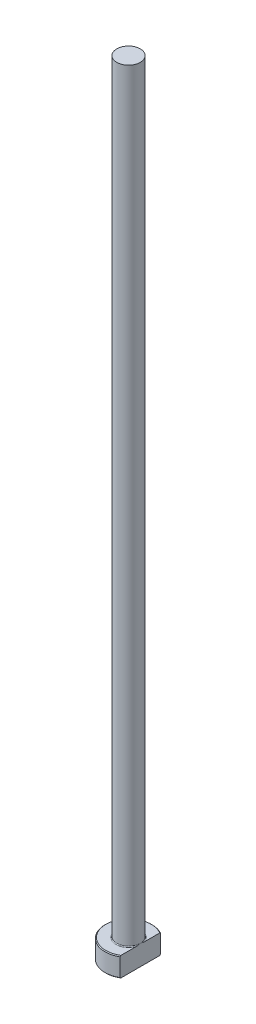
ISO-10303-21;
HEADER;
FILE_DESCRIPTION(('STEP AP214'),'2;1');
FILE_NAME('part.step','',(''),(''),'','','');
FILE_SCHEMA(('AUTOMOTIVE_DESIGN { 1 0 10303 214 1 1 1 1 }'));
ENDSEC;
DATA;
#1=APPLICATION_CONTEXT('core data for automotive mechanical design processes');
#2=APPLICATION_PROTOCOL_DEFINITION('international standard','automotive_design',2000,#1);
#3=PRODUCT_CONTEXT('',#1,'mechanical');
#4=PRODUCT('Part','Part','',(#3));
#5=PRODUCT_RELATED_PRODUCT_CATEGORY('part','',(#4));
#6=PRODUCT_DEFINITION_FORMATION('','',#4);
#7=PRODUCT_DEFINITION_CONTEXT('part definition',#1,'design');
#8=PRODUCT_DEFINITION('design','',#6,#7);
#9=PRODUCT_DEFINITION_SHAPE('','',#8);
#10=(LENGTH_UNIT() NAMED_UNIT(*) SI_UNIT(.MILLI.,.METRE.));
#11=(NAMED_UNIT(*) PLANE_ANGLE_UNIT() SI_UNIT($,.RADIAN.));
#12=(NAMED_UNIT(*) SI_UNIT($,.STERADIAN.) SOLID_ANGLE_UNIT());
#13=UNCERTAINTY_MEASURE_WITH_UNIT(LENGTH_MEASURE(1.E-05),#10,'distance_accuracy_value','');
#14=(GEOMETRIC_REPRESENTATION_CONTEXT(3) GLOBAL_UNCERTAINTY_ASSIGNED_CONTEXT((#13)) GLOBAL_UNIT_ASSIGNED_CONTEXT((#10,
#11,#12)) REPRESENTATION_CONTEXT('',''));
#15=CARTESIAN_POINT('',(0.,0.,0.));
#16=DIRECTION('',(0.,0.,1.));
#17=DIRECTION('',(1.,0.,0.));
#18=AXIS2_PLACEMENT_3D('',#15,#16,#17);
#19=CARTESIAN_POINT('',(0.,0.,0.));
#20=DIRECTION('',(0.,-1.,0.));
#21=DIRECTION('',(0.,0.,-1.));
#22=AXIS2_PLACEMENT_3D('',#19,#20,#21);
#23=PLANE('',#22);
#24=CARTESIAN_POINT('',(0.,0.,0.));
#25=DIRECTION('',(0.,-1.,0.));
#26=DIRECTION('',(0.,0.,-1.));
#27=AXIS2_PLACEMENT_3D('',#24,#25,#26);
#28=CIRCLE('',#27,5.79999999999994);
#29=CARTESIAN_POINT('',(2.99999999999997,0.,4.9638694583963));
#30=VERTEX_POINT('',#29);
#31=CARTESIAN_POINT('',(2.99999999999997,0.,-4.9638694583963));
#32=VERTEX_POINT('',#31);
#33=EDGE_CURVE('E98',#30,#32,#28,.T.);
#34=ORIENTED_EDGE('',*,*,#33,.T.);
#35=DIRECTION('',(0.,0.,1.));
#36=VECTOR('',#35,1.);
#37=CARTESIAN_POINT('',(2.99999999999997,0.,-5.19615242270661));
#38=LINE('',#37,#36);
#39=EDGE_CURVE('E83',#32,#30,#38,.T.);
#40=ORIENTED_EDGE('',*,*,#39,.T.);
#41=EDGE_LOOP('',(#34,#40));
#42=FACE_BOUND('',#41,.T.);
#43=ADVANCED_FACE('F32',(#42),#23,.T.);
#44=CARTESIAN_POINT('',(0.,259.958771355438,0.));
#45=DIRECTION('',(0.,1.,0.));
#46=DIRECTION('',(0.,0.,1.));
#47=AXIS2_PLACEMENT_3D('',#44,#45,#46);
#48=CYLINDRICAL_SURFACE('',#47,5.99999999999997);
#49=CARTESIAN_POINT('',(0.,4.80000000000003,0.));
#50=DIRECTION('',(0.,1.,0.));
#51=DIRECTION('',(0.,0.,1.));
#52=AXIS2_PLACEMENT_3D('',#49,#50,#51);
#53=CIRCLE('',#52,5.99999999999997);
#54=CARTESIAN_POINT('',(2.99999999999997,4.80000000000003,5.19615242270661));
#55=VERTEX_POINT('',#54);
#56=CARTESIAN_POINT('',(2.99999999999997,4.80000000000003,-5.19615242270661));
#57=VERTEX_POINT('',#56);
#58=EDGE_CURVE('E104',#55,#57,#53,.F.);
#59=ORIENTED_EDGE('',*,*,#58,.T.);
#60=DIRECTION('',(0.,-1.,0.));
#61=VECTOR('',#60,1.);
#62=CARTESIAN_POINT('',(2.99999999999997,200.,-5.19615242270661));
#63=LINE('',#62,#61);
#64=CARTESIAN_POINT('',(2.99999999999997,0.200000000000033,-5.19615242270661));
#65=VERTEX_POINT('',#64);
#66=EDGE_CURVE('E183',#57,#65,#63,.T.);
#67=ORIENTED_EDGE('',*,*,#66,.T.);
#68=CARTESIAN_POINT('',(0.,0.200000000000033,0.));
#69=DIRECTION('',(0.,-1.,0.));
#70=DIRECTION('',(0.,0.,-1.));
#71=AXIS2_PLACEMENT_3D('',#68,#69,#70);
#72=CIRCLE('',#71,5.99999999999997);
#73=CARTESIAN_POINT('',(2.99999999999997,0.200000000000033,5.19615242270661));
#74=VERTEX_POINT('',#73);
#75=EDGE_CURVE('E100',#65,#74,#72,.F.);
#76=ORIENTED_EDGE('',*,*,#75,.T.);
#77=DIRECTION('',(0.,-1.,0.));
#78=VECTOR('',#77,1.);
#79=CARTESIAN_POINT('',(2.99999999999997,200.,5.19615242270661));
#80=LINE('',#79,#78);
#81=EDGE_CURVE('E93',#55,#74,#80,.T.);
#82=ORIENTED_EDGE('',*,*,#81,.F.);
#83=EDGE_LOOP('',(#59,#67,#76,#82));
#84=FACE_BOUND('',#83,.T.);
#85=ADVANCED_FACE('F158',(#84),#48,.T.);
#86=CARTESIAN_POINT('',(-5.99999999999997,5.,0.));
#87=DIRECTION('',(0.,1.,0.));
#88=DIRECTION('',(0.,0.,1.));
#89=AXIS2_PLACEMENT_3D('',#86,#87,#88);
#90=PLANE('',#89);
#91=CARTESIAN_POINT('',(0.,5.,0.));
#92=DIRECTION('',(0.,1.,0.));
#93=DIRECTION('',(0.,0.,1.));
#94=AXIS2_PLACEMENT_3D('',#91,#92,#93);
#95=CIRCLE('',#94,5.79999999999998);
#96=CARTESIAN_POINT('',(2.99999999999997,5.,-4.96386945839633));
#97=VERTEX_POINT('',#96);
#98=CARTESIAN_POINT('',(2.99999999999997,5.,4.96386945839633));
#99=VERTEX_POINT('',#98);
#100=EDGE_CURVE('E178',#97,#99,#95,.T.);
#101=ORIENTED_EDGE('',*,*,#100,.T.);
#102=DIRECTION('',(0.,0.,-1.));
#103=VECTOR('',#102,1.);
#104=CARTESIAN_POINT('',(2.99999999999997,5.,0.));
#105=LINE('',#104,#103);
#106=CARTESIAN_POINT('',(2.99999999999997,4.99999999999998,1.11355287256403));
#107=VERTEX_POINT('',#106);
#108=EDGE_CURVE('E57',#99,#107,#105,.T.);
#109=ORIENTED_EDGE('',*,*,#108,.T.);
#110=CARTESIAN_POINT('',(0.,5.,0.));
#111=DIRECTION('',(0.,1.,0.));
#112=DIRECTION('',(0.,0.,1.));
#113=AXIS2_PLACEMENT_3D('',#110,#111,#112);
#114=CIRCLE('',#113,3.19999999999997);
#115=CARTESIAN_POINT('',(2.99999999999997,4.99999999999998,-1.113552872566));
#116=VERTEX_POINT('',#115);
#117=EDGE_CURVE('E107',#107,#116,#114,.F.);
#118=ORIENTED_EDGE('',*,*,#117,.T.);
#119=EDGE_CURVE('E136',#116,#97,#105,.T.);
#120=ORIENTED_EDGE('',*,*,#119,.T.);
#121=EDGE_LOOP('',(#101,#109,#118,#120));
#122=FACE_BOUND('',#121,.T.);
#123=ADVANCED_FACE('F147',(#122),#90,.T.);
#124=CARTESIAN_POINT('',(0.,5.,0.));
#125=DIRECTION('',(0.,-1.,0.));
#126=DIRECTION('',(0.,0.,-1.));
#127=AXIS2_PLACEMENT_3D('',#124,#125,#126);
#128=CONICAL_SURFACE('',#127,5.79999999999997,0.785398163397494);
#129=ORIENTED_EDGE('',*,*,#58,.F.);
#130=CARTESIAN_POINT('',(2.99999999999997,-1.01993959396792,11.432889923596));
#131=CARTESIAN_POINT('',(2.99999999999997,-0.769424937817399,11.1738796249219));
#132=CARTESIAN_POINT('',(2.99999999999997,-0.519179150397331,10.9146084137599));
#133=CARTESIAN_POINT('',(2.99999999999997,-0.0193842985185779,10.395389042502));
#134=CARTESIAN_POINT('',(2.99999999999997,0.230164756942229,10.1354408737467));
#135=CARTESIAN_POINT('',(2.99999999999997,0.728528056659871,9.61458602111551));
#136=CARTESIAN_POINT('',(2.99999999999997,0.977341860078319,9.35367891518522));
#137=CARTESIAN_POINT('',(2.99999999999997,1.47386965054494,8.83082274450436));
#138=CARTESIAN_POINT('',(2.99999999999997,1.72158364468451,8.56887368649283));
#139=CARTESIAN_POINT('',(2.99999999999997,2.21069282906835,8.04884148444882));
#140=CARTESIAN_POINT('',(2.99999999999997,2.4521159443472,7.79078462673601));
#141=CARTESIAN_POINT('',(2.99999999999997,2.93315589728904,7.27299342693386));
#142=CARTESIAN_POINT('',(2.99999999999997,3.17277274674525,7.01325909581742));
#143=CARTESIAN_POINT('',(2.99999999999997,3.64950020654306,6.49159990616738));
#144=CARTESIAN_POINT('',(2.99999999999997,3.88661134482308,6.22967553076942));
#145=CARTESIAN_POINT('',(2.99999999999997,4.35738571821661,5.70275148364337));
#146=CARTESIAN_POINT('',(2.99999999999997,4.59104909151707,5.43775193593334));
#147=CARTESIAN_POINT('',(2.99999999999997,4.96416348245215,5.00636825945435));
#148=CARTESIAN_POINT('',(2.99999999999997,5.1052013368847,4.8413584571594));
#149=CARTESIAN_POINT('',(2.99999999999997,5.38476673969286,4.50919282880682));
#150=CARTESIAN_POINT('',(2.99999999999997,5.52329404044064,4.34203679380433));
#151=CARTESIAN_POINT('',(2.99999999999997,5.79842961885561,4.0031993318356));
#152=CARTESIAN_POINT('',(2.99999999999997,5.93500216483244,3.83148875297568));
#153=CARTESIAN_POINT('',(2.99999999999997,6.20336281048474,3.4844211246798));
#154=CARTESIAN_POINT('',(2.99999999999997,6.33515205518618,3.30906496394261));
#155=CARTESIAN_POINT('',(2.99999999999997,6.5939338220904,2.9507080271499));
#156=CARTESIAN_POINT('',(2.99999999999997,6.72082315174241,2.76763161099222));
#157=CARTESIAN_POINT('',(2.99999999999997,6.90336321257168,2.48771743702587));
#158=CARTESIAN_POINT('',(2.99999999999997,6.96295431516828,2.39345390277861));
#159=CARTESIAN_POINT('',(2.99999999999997,7.07882720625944,2.20292146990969));
#160=CARTESIAN_POINT('',(2.99999999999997,7.13510937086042,2.10665280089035));
#161=CARTESIAN_POINT('',(2.99999999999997,7.24288059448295,1.91297779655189));
#162=CARTESIAN_POINT('',(2.99999999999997,7.29441986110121,1.81559978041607));
#163=CARTESIAN_POINT('',(2.99999999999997,7.39241237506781,1.61833215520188));
#164=CARTESIAN_POINT('',(2.99999999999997,7.43886469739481,1.51844209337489));
#165=CARTESIAN_POINT('',(2.99999999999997,7.56840030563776,1.21511948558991));
#166=CARTESIAN_POINT('',(2.99999999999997,7.64209011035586,1.00730397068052));
#167=CARTESIAN_POINT('',(2.99999999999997,7.72186700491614,0.695731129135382));
#168=CARTESIAN_POINT('',(2.99999999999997,7.74302901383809,0.595791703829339));
#169=CARTESIAN_POINT('',(2.99999999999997,7.77582528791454,0.394325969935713));
#170=CARTESIAN_POINT('',(2.99999999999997,7.78746040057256,0.292799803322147));
#171=CARTESIAN_POINT('',(2.99999999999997,7.80037895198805,0.0893987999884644));
#172=CARTESIAN_POINT('',(2.99999999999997,7.80169449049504,-0.0124739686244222));
#173=CARTESIAN_POINT('',(2.99999999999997,7.79396363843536,-0.215826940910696));
#174=CARTESIAN_POINT('',(2.99999999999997,7.78491639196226,-0.317307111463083));
#175=CARTESIAN_POINT('',(2.99999999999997,7.75721241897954,-0.518039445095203));
#176=CARTESIAN_POINT('',(2.99999999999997,7.73863812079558,-0.61730321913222));
#177=CARTESIAN_POINT('',(2.99999999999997,7.6930395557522,-0.813850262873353));
#178=CARTESIAN_POINT('',(2.99999999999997,7.66601427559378,-0.911133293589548));
#179=CARTESIAN_POINT('',(2.99999999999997,7.60464499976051,-1.10394843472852));
#180=CARTESIAN_POINT('',(2.99999999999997,7.57025976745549,-1.19946724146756));
#181=CARTESIAN_POINT('',(2.99999999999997,7.4955576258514,-1.38810736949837));
#182=CARTESIAN_POINT('',(2.99999999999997,7.45524192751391,-1.48122917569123));
#183=CARTESIAN_POINT('',(2.99999999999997,7.36961028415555,-1.66561491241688));
#184=CARTESIAN_POINT('',(2.99999999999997,7.32427350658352,-1.75686908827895));
#185=CARTESIAN_POINT('',(2.99999999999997,7.22966073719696,-1.93732130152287));
#186=CARTESIAN_POINT('',(2.99999999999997,7.18038388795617,-2.02651888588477));
#187=CARTESIAN_POINT('',(2.99999999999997,7.02771106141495,-2.29153460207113));
#188=CARTESIAN_POINT('',(2.99999999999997,6.91955486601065,-2.46460625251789));
#189=CARTESIAN_POINT('',(2.99999999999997,6.69440299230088,-2.80577028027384));
#190=CARTESIAN_POINT('',(2.99999999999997,6.57737415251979,-2.97384034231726));
#191=CARTESIAN_POINT('',(2.99999999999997,6.33748949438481,-3.30561771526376));
#192=CARTESIAN_POINT('',(2.99999999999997,6.21463662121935,-3.46932716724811));
#193=CARTESIAN_POINT('',(2.99999999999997,5.96308085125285,-3.79561670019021));
#194=CARTESIAN_POINT('',(2.99999999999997,5.83432224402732,-3.95815356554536));
#195=CARTESIAN_POINT('',(2.99999999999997,5.57361365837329,-4.28066737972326));
#196=CARTESIAN_POINT('',(2.99999999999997,5.44166333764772,-4.44064405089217));
#197=CARTESIAN_POINT('',(2.99999999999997,5.17568445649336,-4.75819552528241));
#198=CARTESIAN_POINT('',(2.99999999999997,5.04166171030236,-4.91577521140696));
#199=CARTESIAN_POINT('',(2.99999999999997,4.77176230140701,-5.22934053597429));
#200=CARTESIAN_POINT('',(2.99999999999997,4.63588560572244,-5.38532614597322));
#201=CARTESIAN_POINT('',(2.99999999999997,4.27256222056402,-5.79849838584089));
#202=CARTESIAN_POINT('',(2.99999999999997,4.04384014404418,-6.054562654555));
#203=CARTESIAN_POINT('',(2.99999999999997,3.58360020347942,-6.5641703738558));
#204=CARTESIAN_POINT('',(2.99999999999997,3.35208226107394,-6.81771375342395));
#205=CARTESIAN_POINT('',(2.99999999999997,2.88678846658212,-7.32315936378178));
#206=CARTESIAN_POINT('',(2.99999999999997,2.65301069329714,-7.57505982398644));
#207=CARTESIAN_POINT('',(2.99999999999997,2.18392232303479,-8.07742926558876));
#208=CARTESIAN_POINT('',(2.99999999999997,1.94861172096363,-8.32789824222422));
#209=CARTESIAN_POINT('',(2.99999999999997,1.4865158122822,-8.81743943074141));
#210=CARTESIAN_POINT('',(2.99999999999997,1.25977806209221,-9.05655656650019));
#211=CARTESIAN_POINT('',(2.99999999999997,0.805439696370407,-9.53397105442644));
#212=CARTESIAN_POINT('',(2.99999999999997,0.577839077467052,-9.77226840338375));
#213=CARTESIAN_POINT('',(2.99999999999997,0.122198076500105,-10.2479325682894));
#214=CARTESIAN_POINT('',(2.99999999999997,-0.105841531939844,-10.4853001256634));
#215=CARTESIAN_POINT('',(2.99999999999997,-0.562491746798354,-10.9594816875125));
#216=CARTESIAN_POINT('',(2.99999999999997,-0.791102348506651,-11.1962956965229));
#217=CARTESIAN_POINT('',(2.99999999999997,-1.01993959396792,-11.432889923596));
#218=B_SPLINE_CURVE_WITH_KNOTS('',3,(#130,#131,#132,#133,#134,#135,#136,#137,#138,#139,#140,
#141,#142,#143,#144,#145,#146,#147,#148,#149,#150,#151,#152,#153,#154,#155,#156,#157,#158,#159,
#160,#161,#162,#163,#164,#165,#166,#167,#168,#169,#170,#171,#172,#173,#174,#175,#176,#177,#178,
#179,#180,#181,#182,#183,#184,#185,#186,#187,#188,#189,#190,#191,#192,#193,#194,#195,#196,#197,
#198,#199,#200,#201,#202,#203,#204,#205,#206,#207,#208,#209,#210,#211,#212,#213,#214,#215,#216,
#217),.UNSPECIFIED.,.F.,.F.,(4,2,2,2,2,2,2,2,2,2,2,2,2,2,2,2,2,2,2,2,2,2,2,2,2,2,2,2,2,2,2,2,2,
2,2,2,2,2,2,2,2,2,2,4),(0.,1.08101662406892,2.16204714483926,3.24363027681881,4.32520642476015,
5.3853446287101,6.44547590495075,7.50537917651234,8.56523985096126,9.21643479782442,
9.86769362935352,10.5258323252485,11.1838124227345,11.851781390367,12.1862877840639,
12.5207560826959,12.8511332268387,13.1815703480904,13.8399161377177,14.1460077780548,
14.4520721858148,14.7571841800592,15.0623213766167,15.3648619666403,15.6674388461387,
15.9717575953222,16.2760142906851,16.5815843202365,16.8872210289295,17.4990577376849,
18.1133060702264,18.7272470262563,19.3492675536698,19.9713550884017,20.5919343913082,
21.2125247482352,22.2425132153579,23.2725306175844,24.3035181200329,25.3345090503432,
26.3230827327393,27.3116602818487,28.299135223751,29.286602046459),.UNSPECIFIED.);
#219=EDGE_CURVE('E135',#55,#99,#218,.T.);
#220=ORIENTED_EDGE('',*,*,#219,.T.);
#221=ORIENTED_EDGE('',*,*,#100,.F.);
#222=EDGE_CURVE('E127',#97,#57,#218,.T.);
#223=ORIENTED_EDGE('',*,*,#222,.T.);
#224=EDGE_LOOP('',(#129,#220,#221,#223));
#225=FACE_BOUND('',#224,.T.);
#226=ADVANCED_FACE('F143',(#225),#128,.T.);
#227=CARTESIAN_POINT('',(0.,0.200000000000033,0.));
#228=DIRECTION('',(0.,1.,0.));
#229=DIRECTION('',(0.,0.,1.));
#230=AXIS2_PLACEMENT_3D('',#227,#228,#229);
#231=CONICAL_SURFACE('',#230,5.99999999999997,0.785398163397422);
#232=ORIENTED_EDGE('',*,*,#75,.F.);
#233=CARTESIAN_POINT('',(2.99999999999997,6.01993959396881,-11.432889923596));
#234=CARTESIAN_POINT('',(2.99999999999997,5.76942493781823,-11.1738796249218));
#235=CARTESIAN_POINT('',(2.99999999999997,5.5191791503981,-10.9146084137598));
#236=CARTESIAN_POINT('',(2.99999999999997,5.01938429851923,-10.3953890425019));
#237=CARTESIAN_POINT('',(2.99999999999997,4.76983524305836,-10.1354408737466));
#238=CARTESIAN_POINT('',(2.99999999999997,4.27147194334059,-9.61458602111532));
#239=CARTESIAN_POINT('',(2.99999999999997,4.02265813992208,-9.35367891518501));
#240=CARTESIAN_POINT('',(2.99999999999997,3.52613034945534,-8.83082274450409));
#241=CARTESIAN_POINT('',(2.99999999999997,3.27841635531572,-8.56887368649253));
#242=CARTESIAN_POINT('',(2.99999999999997,2.78930717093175,-8.04884148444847));
#243=CARTESIAN_POINT('',(2.99999999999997,2.54788405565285,-7.79078462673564));
#244=CARTESIAN_POINT('',(2.99999999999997,2.0668441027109,-7.27299342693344));
#245=CARTESIAN_POINT('',(2.99999999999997,1.82722725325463,-7.01325909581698));
#246=CARTESIAN_POINT('',(2.99999999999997,1.35049979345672,-6.49159990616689));
#247=CARTESIAN_POINT('',(2.99999999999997,1.11338865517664,-6.2296755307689));
#248=CARTESIAN_POINT('',(2.99999999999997,0.642614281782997,-5.70275148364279));
#249=CARTESIAN_POINT('',(2.99999999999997,0.408950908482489,-5.43775193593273));
#250=CARTESIAN_POINT('',(2.99999999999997,0.0358365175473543,-5.00636825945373));
#251=CARTESIAN_POINT('',(2.99999999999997,-0.105201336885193,-4.8413584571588));
#252=CARTESIAN_POINT('',(2.99999999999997,-0.384766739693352,-4.50919282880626));
#253=CARTESIAN_POINT('',(2.99999999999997,-0.523294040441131,-4.34203679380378));
#254=CARTESIAN_POINT('',(2.99999999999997,-0.7984296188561,-4.00319933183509));
#255=CARTESIAN_POINT('',(2.99999999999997,-0.935002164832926,-3.83148875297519));
#256=CARTESIAN_POINT('',(2.99999999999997,-1.20336281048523,-3.48442112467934));
#257=CARTESIAN_POINT('',(2.99999999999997,-1.33515205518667,-3.30906496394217));
#258=CARTESIAN_POINT('',(2.99999999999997,-1.59393382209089,-2.95070802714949));
#259=CARTESIAN_POINT('',(2.99999999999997,-1.7208231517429,-2.76763161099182));
#260=CARTESIAN_POINT('',(2.99999999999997,-1.90336321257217,-2.48771743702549));
#261=CARTESIAN_POINT('',(2.99999999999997,-1.96295431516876,-2.39345390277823));
#262=CARTESIAN_POINT('',(2.99999999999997,-2.07882720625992,-2.20292146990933));
#263=CARTESIAN_POINT('',(2.99999999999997,-2.1351093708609,-2.10665280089));
#264=CARTESIAN_POINT('',(2.99999999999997,-2.24288059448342,-1.91297779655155));
#265=CARTESIAN_POINT('',(2.99999999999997,-2.29441986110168,-1.81559978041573));
#266=CARTESIAN_POINT('',(2.99999999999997,-2.39241237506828,-1.61833215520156));
#267=CARTESIAN_POINT('',(2.99999999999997,-2.43886469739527,-1.51844209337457));
#268=CARTESIAN_POINT('',(2.99999999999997,-2.56840030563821,-1.2151194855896));
#269=CARTESIAN_POINT('',(2.99999999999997,-2.6420901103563,-1.00730397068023));
#270=CARTESIAN_POINT('',(2.99999999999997,-2.72186700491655,-0.69573112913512));
#271=CARTESIAN_POINT('',(2.99999999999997,-2.7430290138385,-0.595791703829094));
#272=CARTESIAN_POINT('',(2.99999999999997,-2.77582528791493,-0.394325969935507));
#273=CARTESIAN_POINT('',(2.99999999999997,-2.78746040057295,-0.292799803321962));
#274=CARTESIAN_POINT('',(2.99999999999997,-2.80037895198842,-0.0893987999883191));
#275=CARTESIAN_POINT('',(2.99999999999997,-2.8016944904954,0.0124739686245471));
#276=CARTESIAN_POINT('',(2.99999999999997,-2.79396363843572,0.215826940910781));
#277=CARTESIAN_POINT('',(2.99999999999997,-2.78491639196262,0.317307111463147));
#278=CARTESIAN_POINT('',(2.99999999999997,-2.7572124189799,0.518039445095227));
#279=CARTESIAN_POINT('',(2.99999999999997,-2.73863812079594,0.617303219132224));
#280=CARTESIAN_POINT('',(2.99999999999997,-2.69303955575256,0.813850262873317));
#281=CARTESIAN_POINT('',(2.99999999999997,-2.66601427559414,0.911133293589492));
#282=CARTESIAN_POINT('',(2.99999999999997,-2.60464499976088,1.10394843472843));
#283=CARTESIAN_POINT('',(2.99999999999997,-2.57025976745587,1.19946724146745));
#284=CARTESIAN_POINT('',(2.99999999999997,-2.49555762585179,1.38810736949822));
#285=CARTESIAN_POINT('',(2.99999999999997,-2.4552419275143,1.48122917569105));
#286=CARTESIAN_POINT('',(2.99999999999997,-2.36961028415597,1.66561491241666));
#287=CARTESIAN_POINT('',(2.99999999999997,-2.32427350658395,1.7568690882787));
#288=CARTESIAN_POINT('',(2.99999999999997,-2.22966073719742,1.93732130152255));
#289=CARTESIAN_POINT('',(2.99999999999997,-2.18038388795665,2.02651888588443));
#290=CARTESIAN_POINT('',(2.99999999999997,-2.02771106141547,2.2915346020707));
#291=CARTESIAN_POINT('',(2.99999999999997,-1.91955486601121,2.4646062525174));
#292=CARTESIAN_POINT('',(2.99999999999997,-1.6944029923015,2.80577028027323));
#293=CARTESIAN_POINT('',(2.99999999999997,-1.57737415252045,2.9738403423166));
#294=CARTESIAN_POINT('',(2.99999999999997,-1.33748949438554,3.30561771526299));
#295=CARTESIAN_POINT('',(2.99999999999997,-1.21463662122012,3.46932716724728));
#296=CARTESIAN_POINT('',(2.99999999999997,-0.96308085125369,3.79561670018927));
#297=CARTESIAN_POINT('',(2.99999999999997,-0.834322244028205,3.95815356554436));
#298=CARTESIAN_POINT('',(2.99999999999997,-0.573613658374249,4.28066737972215));
#299=CARTESIAN_POINT('',(2.99999999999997,-0.441663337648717,4.440644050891));
#300=CARTESIAN_POINT('',(2.99999999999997,-0.175684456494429,4.75819552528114));
#301=CARTESIAN_POINT('',(2.99999999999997,-0.0416617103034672,4.91577521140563));
#302=CARTESIAN_POINT('',(2.99999999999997,0.228237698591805,5.22934053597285));
#303=CARTESIAN_POINT('',(2.99999999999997,0.364114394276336,5.38532614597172));
#304=CARTESIAN_POINT('',(2.99999999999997,0.727437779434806,5.79849838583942));
#305=CARTESIAN_POINT('',(2.99999999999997,0.956159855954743,6.05456265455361));
#306=CARTESIAN_POINT('',(2.99999999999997,1.41639979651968,6.56417037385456));
#307=CARTESIAN_POINT('',(2.99999999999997,1.64791773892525,6.81771375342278));
#308=CARTESIAN_POINT('',(2.99999999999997,2.11321153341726,7.32315936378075));
#309=CARTESIAN_POINT('',(2.99999999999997,2.34698930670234,7.57505982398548));
#310=CARTESIAN_POINT('',(2.99999999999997,2.81607767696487,8.07742926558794));
#311=CARTESIAN_POINT('',(2.99999999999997,3.05138827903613,8.32789824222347));
#312=CARTESIAN_POINT('',(2.99999999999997,3.51348418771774,8.81743943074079));
#313=CARTESIAN_POINT('',(2.99999999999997,3.74022193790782,9.05655656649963));
#314=CARTESIAN_POINT('',(2.99999999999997,4.1945603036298,9.53397105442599));
#315=CARTESIAN_POINT('',(2.99999999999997,4.42216092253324,9.77226840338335));
#316=CARTESIAN_POINT('',(2.99999999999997,4.87780192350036,10.2479325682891));
#317=CARTESIAN_POINT('',(2.99999999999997,5.10584153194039,10.4853001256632));
#318=CARTESIAN_POINT('',(2.99999999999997,5.56249174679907,10.9594816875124));
#319=CARTESIAN_POINT('',(2.99999999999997,5.79110234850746,11.1962956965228));
#320=CARTESIAN_POINT('',(2.99999999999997,6.01993959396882,11.432889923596));
#321=B_SPLINE_CURVE_WITH_KNOTS('',3,(#233,#234,#235,#236,#237,#238,#239,#240,#241,#242,#243,
#244,#245,#246,#247,#248,#249,#250,#251,#252,#253,#254,#255,#256,#257,#258,#259,#260,#261,#262,
#263,#264,#265,#266,#267,#268,#269,#270,#271,#272,#273,#274,#275,#276,#277,#278,#279,#280,#281,
#282,#283,#284,#285,#286,#287,#288,#289,#290,#291,#292,#293,#294,#295,#296,#297,#298,#299,#300,
#301,#302,#303,#304,#305,#306,#307,#308,#309,#310,#311,#312,#313,#314,#315,#316,#317,#318,#319,
#320),.UNSPECIFIED.,.F.,.F.,(4,2,2,2,2,2,2,2,2,2,2,2,2,2,2,2,2,2,2,2,2,2,2,2,2,2,2,2,2,2,2,2,2,
2,2,2,2,2,2,2,2,2,2,4),(0.,1.08101662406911,2.16204714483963,3.24363027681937,4.32520642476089,
5.38534462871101,6.44547590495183,7.50537917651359,8.56523985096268,9.21643479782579,
9.86769362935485,10.5258323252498,11.1838124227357,11.8517813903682,12.1862877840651,
12.5207560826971,12.8511332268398,13.1815703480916,13.8399161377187,14.1460077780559,
14.4520721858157,14.7571841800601,15.0623213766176,15.3648619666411,15.6674388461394,
15.9717575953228,16.2760142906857,16.581584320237,16.8872210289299,17.4990577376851,
18.1133060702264,18.7272470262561,19.3492675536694,19.9713550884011,20.5919343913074,
21.2125247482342,22.2425132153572,23.2725306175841,24.3035181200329,25.3345090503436,
26.32308273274,27.3116602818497,28.2991352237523,29.2866020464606),.UNSPECIFIED.);
#322=EDGE_CURVE('E86',#65,#32,#321,.T.);
#323=ORIENTED_EDGE('',*,*,#322,.T.);
#324=ORIENTED_EDGE('',*,*,#33,.F.);
#325=EDGE_CURVE('E89',#30,#74,#321,.T.);
#326=ORIENTED_EDGE('',*,*,#325,.T.);
#327=EDGE_LOOP('',(#232,#323,#324,#326));
#328=FACE_BOUND('',#327,.T.);
#329=ADVANCED_FACE('F97',(#328),#231,.T.);
#330=CARTESIAN_POINT('',(0.,5.19999999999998,0.));
#331=DIRECTION('',(0.,1.,0.));
#332=DIRECTION('',(0.,0.,1.));
#333=AXIS2_PLACEMENT_3D('',#330,#331,#332);
#334=TOROIDAL_SURFACE('',#333,3.19999999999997,0.2);
#335=CARTESIAN_POINT('',(2.99999999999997,5.19999999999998,0.));
#336=CARTESIAN_POINT('',(2.99999999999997,5.20000054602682,-8.25589702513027E-09));
#337=CARTESIAN_POINT('',(2.99999999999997,5.20000108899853,-2.22623702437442E-07));
#338=CARTESIAN_POINT('',(2.99999999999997,5.20000210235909,-8.13181300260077E-07));
#339=CARTESIAN_POINT('',(2.99999999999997,5.20000256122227,-1.20262206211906E-06));
#340=CARTESIAN_POINT('',(2.99999999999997,5.20000351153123,-2.13233189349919E-06));
#341=CARTESIAN_POINT('',(2.99999999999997,5.2000039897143,-2.68711073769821E-06));
#342=CARTESIAN_POINT('',(2.99999999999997,5.20000484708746,-3.83722986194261E-06));
#343=CARTESIAN_POINT('',(2.99999999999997,5.20000522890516,-4.43075968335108E-06));
#344=CARTESIAN_POINT('',(2.99999999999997,5.20000663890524,-6.71805399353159E-06));
#345=CARTESIAN_POINT('',(2.99999999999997,5.20000758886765,-8.46267320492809E-06));
#346=CARTESIAN_POINT('',(2.99999999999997,5.20000915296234,-1.19195937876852E-05));
#347=CARTESIAN_POINT('',(2.99999999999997,5.20000978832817,-1.36226966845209E-05));
#348=CARTESIAN_POINT('',(2.99999999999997,5.20001243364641,-2.07785327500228E-05));
#349=CARTESIAN_POINT('',(2.99999999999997,5.20001439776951,-2.62512686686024E-05));
#350=CARTESIAN_POINT('',(2.99999999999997,5.20001730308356,-3.65971251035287E-05));
#351=CARTESIAN_POINT('',(2.99999999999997,5.20001835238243,-4.14397201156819E-05));
#352=CARTESIAN_POINT('',(2.99999999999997,5.20002589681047,-7.68826107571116E-05));
#353=CARTESIAN_POINT('',(2.99999999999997,5.20003169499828,-0.000107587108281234));
#354=CARTESIAN_POINT('',(2.99999999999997,5.20005649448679,-0.000225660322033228));
#355=CARTESIAN_POINT('',(2.99999999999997,5.2000799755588,-0.000312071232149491));
#356=CARTESIAN_POINT('',(2.99999999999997,5.2001671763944,-0.000638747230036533));
#357=CARTESIAN_POINT('',(2.99999999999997,5.20022823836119,-0.000879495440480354));
#358=CARTESIAN_POINT('',(2.99999999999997,5.20046253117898,-0.00179757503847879));
#359=CARTESIAN_POINT('',(2.99999999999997,5.20063826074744,-0.00247448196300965));
#360=CARTESIAN_POINT('',(2.99999999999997,5.20145771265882,-0.00563611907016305));
#361=CARTESIAN_POINT('',(2.99999999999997,5.20209802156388,-0.00812138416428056));
#362=CARTESIAN_POINT('',(2.99999999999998,5.207470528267,-0.0289666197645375));
#363=CARTESIAN_POINT('',(2.99999999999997,5.2122144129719,-0.0473249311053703));
#364=CARTESIAN_POINT('',(2.99999999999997,5.2215041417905,-0.0833908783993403));
#365=CARTESIAN_POINT('',(2.99999999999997,5.22605099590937,-0.101098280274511));
#366=CARTESIAN_POINT('',(2.99999999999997,5.24071513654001,-0.158441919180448));
#367=CARTESIAN_POINT('',(2.99999999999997,5.25076238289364,-0.198096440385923));
#368=CARTESIAN_POINT('',(2.99999999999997,5.26735876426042,-0.264903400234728));
#369=CARTESIAN_POINT('',(2.99999999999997,5.27400650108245,-0.292031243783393));
#370=CARTESIAN_POINT('',(2.99999999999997,5.28691139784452,-0.345693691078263));
#371=CARTESIAN_POINT('',(2.99999999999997,5.29317409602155,-0.372226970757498));
#372=CARTESIAN_POINT('',(2.99999999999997,5.31359314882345,-0.460847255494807));
#373=CARTESIAN_POINT('',(2.99999999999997,5.3271194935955,-0.52308420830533));
#374=CARTESIAN_POINT('',(2.99999999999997,5.35185224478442,-0.648627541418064));
#375=CARTESIAN_POINT('',(2.99999999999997,5.36303576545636,-0.711938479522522));
#376=CARTESIAN_POINT('',(2.99999999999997,5.382697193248,-0.845442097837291));
#377=CARTESIAN_POINT('',(2.99999999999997,5.39079783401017,-0.915695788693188));
#378=CARTESIAN_POINT('',(2.99999999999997,5.39788104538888,-1.02128246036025));
#379=CARTESIAN_POINT('',(2.99999999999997,5.399399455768,-1.05644278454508));
#380=CARTESIAN_POINT('',(2.99999999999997,5.40031405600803,-1.12678521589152));
#381=CARTESIAN_POINT('',(2.99999999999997,5.39971158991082,-1.16196729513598));
#382=CARTESIAN_POINT('',(2.99999999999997,5.39660553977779,-1.21713951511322));
#383=CARTESIAN_POINT('',(2.99999999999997,5.39502683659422,-1.23718181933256));
#384=CARTESIAN_POINT('',(2.99999999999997,5.39080008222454,-1.27717351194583));
#385=CARTESIAN_POINT('',(2.99999999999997,5.38815120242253,-1.29712281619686));
#386=CARTESIAN_POINT('',(2.99999999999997,5.38160570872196,-1.33655702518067));
#387=CARTESIAN_POINT('',(2.99999999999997,5.37772556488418,-1.35604460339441));
#388=CARTESIAN_POINT('',(2.99999999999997,5.36841119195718,-1.39463554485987));
#389=CARTESIAN_POINT('',(2.99999999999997,5.36297874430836,-1.41373932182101));
#390=CARTESIAN_POINT('',(2.99999999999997,5.3500393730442,-1.45151809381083));
#391=CARTESIAN_POINT('',(2.99999999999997,5.34250654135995,-1.47018435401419));
#392=CARTESIAN_POINT('',(2.99999999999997,5.32469433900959,-1.50617232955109));
#393=CARTESIAN_POINT('',(2.99999999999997,5.31442814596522,-1.52349999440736));
#394=CARTESIAN_POINT('',(2.99999999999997,5.29768486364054,-1.5453003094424));
#395=CARTESIAN_POINT('',(2.99999999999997,5.29285641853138,-1.551032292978));
#396=CARTESIAN_POINT('',(2.99999999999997,5.28257691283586,-1.56192749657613));
#397=CARTESIAN_POINT('',(2.99999999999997,5.27712536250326,-1.56709026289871));
#398=CARTESIAN_POINT('',(2.99999999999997,5.26548354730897,-1.57666725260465));
#399=CARTESIAN_POINT('',(2.99999999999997,5.25928560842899,-1.58107232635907));
#400=CARTESIAN_POINT('',(2.99999999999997,5.24620912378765,-1.5887219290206));
#401=CARTESIAN_POINT('',(2.99999999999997,5.23933242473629,-1.59196950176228));
#402=CARTESIAN_POINT('',(2.99999999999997,5.22702406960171,-1.5962468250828));
#403=CARTESIAN_POINT('',(2.99999999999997,5.2217197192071,-1.59764171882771));
#404=CARTESIAN_POINT('',(2.99999999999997,5.2109516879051,-1.59951721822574));
#405=CARTESIAN_POINT('',(2.99999999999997,5.20548813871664,-1.59999855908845));
#406=CARTESIAN_POINT('',(2.99999999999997,5.19455397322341,-1.60000143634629));
#407=CARTESIAN_POINT('',(2.99999999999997,5.18908335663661,-1.59952177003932));
#408=CARTESIAN_POINT('',(2.99999999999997,5.17830149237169,-1.59764696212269));
#409=CARTESIAN_POINT('',(2.99999999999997,5.17299036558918,-1.59625114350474));
#410=CARTESIAN_POINT('',(2.99999999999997,5.16137413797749,-1.5922159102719));
#411=CARTESIAN_POINT('',(2.99999999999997,5.15514663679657,-1.58935479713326));
#412=CARTESIAN_POINT('',(2.99999999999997,5.14323789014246,-1.58266473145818));
#413=CARTESIAN_POINT('',(2.99999999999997,5.13755768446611,-1.57883398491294));
#414=CARTESIAN_POINT('',(2.99999999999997,5.12388989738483,-1.5682309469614));
#415=CARTESIAN_POINT('',(2.99999999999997,5.11627920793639,-1.56097697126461));
#416=CARTESIAN_POINT('',(2.99999999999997,5.10222993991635,-1.54541986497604));
#417=CARTESIAN_POINT('',(2.99999999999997,5.09579438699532,-1.53711411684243));
#418=CARTESIAN_POINT('',(2.99999999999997,5.07874447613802,-1.51234359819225));
#419=CARTESIAN_POINT('',(2.99999999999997,5.06934681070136,-1.49505024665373));
#420=CARTESIAN_POINT('',(2.99999999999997,5.05300413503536,-1.45936637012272));
#421=CARTESIAN_POINT('',(2.99999999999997,5.04606563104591,-1.440973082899));
#422=CARTESIAN_POINT('',(2.99999999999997,5.03343712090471,-1.40170303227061));
#423=CARTESIAN_POINT('',(2.99999999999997,5.02794514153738,-1.38076360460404));
#424=CARTESIAN_POINT('',(2.99999999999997,5.01869119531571,-1.33849708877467));
#425=CARTESIAN_POINT('',(2.99999999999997,5.01493126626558,-1.31716957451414));
#426=CARTESIAN_POINT('',(2.99999999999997,5.00879575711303,-1.27427301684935));
#427=CARTESIAN_POINT('',(2.99999999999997,5.00642327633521,-1.25270354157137));
#428=CARTESIAN_POINT('',(2.99999999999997,5.00283272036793,-1.20948719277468));
#429=CARTESIAN_POINT('',(2.99999999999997,5.00161392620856,-1.18784037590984));
#430=CARTESIAN_POINT('',(2.99999999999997,4.99921193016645,-1.11739576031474));
#431=CARTESIAN_POINT('',(2.99999999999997,4.99998309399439,-1.06853061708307));
#432=CARTESIAN_POINT('',(2.99999999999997,5.00498456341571,-0.970964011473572));
#433=CARTESIAN_POINT('',(2.99999999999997,5.00921876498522,-0.922262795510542));
#434=CARTESIAN_POINT('',(2.99999999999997,5.02027934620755,-0.825023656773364));
#435=CARTESIAN_POINT('',(2.99999999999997,5.02711306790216,-0.776486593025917));
#436=CARTESIAN_POINT('',(2.99999999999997,5.04272509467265,-0.679720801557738));
#437=CARTESIAN_POINT('',(2.99999999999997,5.05150395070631,-0.631492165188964));
#438=CARTESIAN_POINT('',(2.99999999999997,5.07999589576,-0.487173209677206));
#439=CARTESIAN_POINT('',(2.99999999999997,5.10185558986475,-0.391514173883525));
#440=CARTESIAN_POINT('',(2.99999999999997,5.14819769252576,-0.200831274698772));
#441=CARTESIAN_POINT('',(2.99999999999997,5.17268119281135,-0.105807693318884));
#442=CARTESIAN_POINT('',(2.99999999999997,5.19722910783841,-0.0107318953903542));
#443=CARTESIAN_POINT('',(2.99999999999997,5.19724528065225,-0.0106692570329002));
#444=CARTESIAN_POINT('',(2.99999999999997,5.19781243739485,-0.00847232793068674));
#445=CARTESIAN_POINT('',(2.99999999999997,5.19836102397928,-0.00633759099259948));
#446=CARTESIAN_POINT('',(2.99999999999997,5.1991597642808,-0.00325873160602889));
#447=CARTESIAN_POINT('',(2.99999999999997,5.19940591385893,-0.00231386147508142));
#448=CARTESIAN_POINT('',(2.99999999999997,5.19972567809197,-0.00105818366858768));
#449=CARTESIAN_POINT('',(2.99999999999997,5.19980400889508,-0.000748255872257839));
#450=CARTESIAN_POINT('',(2.99999999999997,5.1999122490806,-0.000340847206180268));
#451=CARTESIAN_POINT('',(2.99999999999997,5.19993871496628,-0.000242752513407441));
#452=CARTESIAN_POINT('',(2.99999999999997,5.19996623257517,-0.000111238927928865));
#453=CARTESIAN_POINT('',(2.99999999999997,5.19997237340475,-7.89037769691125E-05));
#454=CARTESIAN_POINT('',(2.99999999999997,5.19998062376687,-4.17973012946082E-05));
#455=CARTESIAN_POINT('',(2.99999999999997,5.19998174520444,-3.68646325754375E-05));
#456=CARTESIAN_POINT('',(2.99999999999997,5.19998486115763,-2.6333709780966E-05));
#457=CARTESIAN_POINT('',(2.99999999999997,5.19998697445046,-2.0770778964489E-05));
#458=CARTESIAN_POINT('',(2.99999999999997,5.19998981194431,-1.35213137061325E-05));
#459=CARTESIAN_POINT('',(2.99999999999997,5.19999048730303,-1.18115060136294E-05));
#460=CARTESIAN_POINT('',(2.99999999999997,5.19999214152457,-8.34771962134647E-06));
#461=CARTESIAN_POINT('',(2.99999999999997,5.19999314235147,-6.60378870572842E-06));
#462=CARTESIAN_POINT('',(2.99999999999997,5.1999946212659,-4.32501646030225E-06));
#463=CARTESIAN_POINT('',(2.99999999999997,5.1999950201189,-3.73587510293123E-06));
#464=CARTESIAN_POINT('',(2.99999999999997,5.19999591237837,-2.59760768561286E-06));
#465=CARTESIAN_POINT('',(2.99999999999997,5.19999640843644,-2.05040430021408E-06));
#466=CARTESIAN_POINT('',(2.99999999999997,5.19999738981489,-1.1384674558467E-06));
#467=CARTESIAN_POINT('',(2.99999999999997,5.19999786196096,-7.58552551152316E-07));
#468=CARTESIAN_POINT('',(2.99999999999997,5.19999889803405,-1.92079005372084E-07));
#469=CARTESIAN_POINT('',(2.99999999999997,5.19999945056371,8.30744745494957E-09));
#470=CARTESIAN_POINT('',(2.99999999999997,5.19999999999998,0.));
#471=B_SPLINE_CURVE_WITH_KNOTS('',3,(#335,#336,#337,#338,#339,#340,#341,#342,#343,#344,#345,
#346,#347,#348,#349,#350,#351,#352,#353,#354,#355,#356,#357,#358,#359,#360,#361,#362,#363,#364,
#365,#366,#367,#368,#369,#370,#371,#372,#373,#374,#375,#376,#377,#378,#379,#380,#381,#382,#383,
#384,#385,#386,#387,#388,#389,#390,#391,#392,#393,#394,#395,#396,#397,#398,#399,#400,#401,#402,
#403,#404,#405,#406,#407,#408,#409,#410,#411,#412,#413,#414,#415,#416,#417,#418,#419,#420,#421,
#422,#423,#424,#425,#426,#427,#428,#429,#430,#431,#432,#433,#434,#435,#436,#437,#438,#439,#440,
#441,#442,#443,#444,#445,#446,#447,#448,#449,#450,#451,#452,#453,#454,#455,#456,#457,#458,#459,
#460,#461,#462,#463,#464,#465,#466,#467,#468,#469,#470),.UNSPECIFIED.,.T.,.F.,(4,2,2,2,2,2,2,2,
2,2,2,2,2,2,2,2,2,2,2,2,2,2,2,2,2,2,2,2,2,2,2,2,2,2,2,2,2,2,2,2,2,2,2,2,2,2,2,2,2,2,2,2,2,2,2,2,
2,2,2,2,2,2,2,2,2,2,2,4),(0.,1.65204701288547E-06,3.45848810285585E-06,5.64280272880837E-06,
7.75882449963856E-06,1.36969712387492E-05,1.9145444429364E-05,3.65603925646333E-05,
5.14083087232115E-05,0.000145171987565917,0.000413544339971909,0.00115890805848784,
0.00325667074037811,0.0109563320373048,0.067838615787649,0.122684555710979,0.245405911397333,
0.329196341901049,0.410983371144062,0.602016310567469,0.79483628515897,1.00673763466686,
1.11227258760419,1.21774067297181,1.27803175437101,1.33836960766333,1.39793215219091,
1.45742661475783,1.51769013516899,1.57766822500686,1.60011625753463,1.62258205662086,
1.64530254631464,1.66796284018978,1.68434680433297,1.70071757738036,1.71710885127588,
1.7335122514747,1.75395806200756,1.77444198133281,1.8058056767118,1.83724902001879,
1.89596356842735,1.95483231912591,2.01967230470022,2.08458838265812,2.14964892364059,
2.21466889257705,2.3610799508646,2.50765595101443,2.65464904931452,2.80168383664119,
3.09594779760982,3.39033467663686,3.39052875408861,3.3971415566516,3.40007033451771,
3.40102967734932,3.4013342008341,3.40143296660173,3.40144812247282,3.40146594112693,
3.40147145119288,3.401477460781,3.40147959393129,3.40148179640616,3.40148361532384,
3.40148527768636),.UNSPECIFIED.);
#472=CARTESIAN_POINT('',(2.99999999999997,5.19999999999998,0.));
#473=VERTEX_POINT('',#472);
#474=EDGE_CURVE('E11',#116,#473,#471,.T.);
#475=ORIENTED_EDGE('',*,*,#474,.F.);
#476=ORIENTED_EDGE('',*,*,#117,.F.);
#477=CARTESIAN_POINT('',(2.99999999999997,5.19999999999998,0.));
#478=CARTESIAN_POINT('',(2.99999999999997,5.19999945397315,8.25589702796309E-09));
#479=CARTESIAN_POINT('',(2.99999999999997,5.19999891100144,2.22623702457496E-07));
#480=CARTESIAN_POINT('',(2.99999999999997,5.19999789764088,8.13181300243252E-07));
#481=CARTESIAN_POINT('',(2.99999999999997,5.19999743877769,1.20262206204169E-06));
#482=CARTESIAN_POINT('',(2.99999999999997,5.19999648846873,2.13233189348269E-06));
#483=CARTESIAN_POINT('',(2.99999999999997,5.19999601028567,2.68711073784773E-06));
#484=CARTESIAN_POINT('',(2.99999999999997,5.19999515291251,3.83722986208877E-06));
#485=CARTESIAN_POINT('',(2.99999999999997,5.1999947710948,4.43075968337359E-06));
#486=CARTESIAN_POINT('',(2.99999999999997,5.19999336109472,6.71805399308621E-06));
#487=CARTESIAN_POINT('',(2.99999999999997,5.19999241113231,8.46267320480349E-06));
#488=CARTESIAN_POINT('',(2.99999999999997,5.19999084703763,1.19195937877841E-05));
#489=CARTESIAN_POINT('',(2.99999999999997,5.1999902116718,1.36226966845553E-05));
#490=CARTESIAN_POINT('',(2.99999999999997,5.19998756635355,2.07785327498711E-05));
#491=CARTESIAN_POINT('',(2.99999999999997,5.19998560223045,2.62512686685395E-05));
#492=CARTESIAN_POINT('',(2.99999999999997,5.1999826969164,3.65971251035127E-05));
#493=CARTESIAN_POINT('',(2.99999999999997,5.19998164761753,4.14397201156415E-05));
#494=CARTESIAN_POINT('',(2.99999999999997,5.19997410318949,7.68826107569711E-05));
#495=CARTESIAN_POINT('',(2.99999999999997,5.19996830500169,0.000107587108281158));
#496=CARTESIAN_POINT('',(2.99999999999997,5.19994350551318,0.000225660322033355));
#497=CARTESIAN_POINT('',(2.99999999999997,5.19992002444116,0.000312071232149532));
#498=CARTESIAN_POINT('',(2.99999999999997,5.19983282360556,0.000638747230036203));
#499=CARTESIAN_POINT('',(2.99999999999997,5.19977176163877,0.000879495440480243));
#500=CARTESIAN_POINT('',(2.99999999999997,5.19953746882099,0.00179757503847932));
#501=CARTESIAN_POINT('',(2.99999999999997,5.19936173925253,0.00247448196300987));
#502=CARTESIAN_POINT('',(2.99999999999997,5.19854228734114,0.00563611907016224));
#503=CARTESIAN_POINT('',(2.99999999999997,5.19790197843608,0.0081213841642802));
#504=CARTESIAN_POINT('',(2.99999999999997,5.19252947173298,0.0289666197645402));
#505=CARTESIAN_POINT('',(2.99999999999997,5.18778558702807,0.0473249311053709));
#506=CARTESIAN_POINT('',(2.99999999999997,5.17849585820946,0.0833908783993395));
#507=CARTESIAN_POINT('',(2.99999999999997,5.17394900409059,0.101098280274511));
#508=CARTESIAN_POINT('',(2.99999999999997,5.15928486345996,0.158441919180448));
#509=CARTESIAN_POINT('',(2.99999999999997,5.14923761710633,0.198096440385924));
#510=CARTESIAN_POINT('',(2.99999999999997,5.13264123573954,0.264903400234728));
#511=CARTESIAN_POINT('',(2.99999999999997,5.12599349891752,0.292031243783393));
#512=CARTESIAN_POINT('',(2.99999999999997,5.11308860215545,0.345693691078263));
#513=CARTESIAN_POINT('',(2.99999999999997,5.10682590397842,0.372226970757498));
#514=CARTESIAN_POINT('',(2.99999999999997,5.08640685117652,0.460847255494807));
#515=CARTESIAN_POINT('',(2.99999999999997,5.07288050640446,0.52308420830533));
#516=CARTESIAN_POINT('',(2.99999999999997,5.04814775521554,0.648627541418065));
#517=CARTESIAN_POINT('',(2.99999999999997,5.0369642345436,0.711938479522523));
#518=CARTESIAN_POINT('',(2.99999999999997,5.01730280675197,0.845442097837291));
#519=CARTESIAN_POINT('',(2.99999999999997,5.0092021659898,0.915695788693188));
#520=CARTESIAN_POINT('',(2.99999999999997,5.00211895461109,1.02128246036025));
#521=CARTESIAN_POINT('',(2.99999999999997,5.00060054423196,1.05644278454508));
#522=CARTESIAN_POINT('',(2.99999999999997,4.99968594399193,1.12678521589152));
#523=CARTESIAN_POINT('',(2.99999999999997,5.00028841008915,1.16196729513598));
#524=CARTESIAN_POINT('',(2.99999999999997,5.00339446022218,1.21713951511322));
#525=CARTESIAN_POINT('',(2.99999999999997,5.00497316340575,1.23718181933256));
#526=CARTESIAN_POINT('',(2.99999999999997,5.00919991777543,1.27717351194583));
#527=CARTESIAN_POINT('',(2.99999999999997,5.01184879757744,1.29712281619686));
#528=CARTESIAN_POINT('',(2.99999999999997,5.01839429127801,1.33655702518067));
#529=CARTESIAN_POINT('',(2.99999999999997,5.02227443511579,1.35604460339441));
#530=CARTESIAN_POINT('',(2.99999999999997,5.03158880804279,1.39463554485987));
#531=CARTESIAN_POINT('',(2.99999999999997,5.0370212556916,1.41373932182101));
#532=CARTESIAN_POINT('',(2.99999999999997,5.04996062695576,1.45151809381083));
#533=CARTESIAN_POINT('',(2.99999999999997,5.05749345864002,1.47018435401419));
#534=CARTESIAN_POINT('',(2.99999999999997,5.07530566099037,1.50617232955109));
#535=CARTESIAN_POINT('',(2.99999999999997,5.08557185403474,1.52349999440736));
#536=CARTESIAN_POINT('',(2.99999999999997,5.10231513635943,1.5453003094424));
#537=CARTESIAN_POINT('',(2.99999999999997,5.10714358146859,1.551032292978));
#538=CARTESIAN_POINT('',(2.99999999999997,5.1174230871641,1.56192749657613));
#539=CARTESIAN_POINT('',(2.99999999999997,5.1228746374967,1.56709026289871));
#540=CARTESIAN_POINT('',(2.99999999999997,5.13451645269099,1.57666725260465));
#541=CARTESIAN_POINT('',(2.99999999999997,5.14071439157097,1.58107232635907));
#542=CARTESIAN_POINT('',(2.99999999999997,5.15379087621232,1.5887219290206));
#543=CARTESIAN_POINT('',(2.99999999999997,5.16066757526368,1.59196950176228));
#544=CARTESIAN_POINT('',(2.99999999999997,5.17297593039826,1.5962468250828));
#545=CARTESIAN_POINT('',(2.99999999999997,5.17828028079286,1.59764171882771));
#546=CARTESIAN_POINT('',(2.99999999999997,5.18904831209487,1.59951721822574));
#547=CARTESIAN_POINT('',(2.99999999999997,5.19451186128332,1.59999855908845));
#548=CARTESIAN_POINT('',(2.99999999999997,5.20544602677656,1.60000143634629));
#549=CARTESIAN_POINT('',(2.99999999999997,5.21091664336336,1.59952177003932));
#550=CARTESIAN_POINT('',(2.99999999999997,5.22169850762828,1.59764696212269));
#551=CARTESIAN_POINT('',(2.99999999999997,5.22700963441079,1.59625114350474));
#552=CARTESIAN_POINT('',(2.99999999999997,5.23862586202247,1.5922159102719));
#553=CARTESIAN_POINT('',(2.99999999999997,5.2448533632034,1.58935479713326));
#554=CARTESIAN_POINT('',(2.99999999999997,5.2567621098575,1.58266473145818));
#555=CARTESIAN_POINT('',(2.99999999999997,5.26244231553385,1.57883398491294));
#556=CARTESIAN_POINT('',(2.99999999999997,5.27611010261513,1.5682309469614));
#557=CARTESIAN_POINT('',(2.99999999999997,5.28372079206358,1.56097697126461));
#558=CARTESIAN_POINT('',(2.99999999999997,5.29777006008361,1.54541986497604));
#559=CARTESIAN_POINT('',(2.99999999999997,5.30420561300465,1.53711411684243));
#560=CARTESIAN_POINT('',(2.99999999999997,5.32125552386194,1.51234359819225));
#561=CARTESIAN_POINT('',(2.99999999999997,5.33065318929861,1.49505024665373));
#562=CARTESIAN_POINT('',(2.99999999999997,5.34699586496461,1.45936637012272));
#563=CARTESIAN_POINT('',(2.99999999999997,5.35393436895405,1.440973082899));
#564=CARTESIAN_POINT('',(2.99999999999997,5.36656287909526,1.40170303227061));
#565=CARTESIAN_POINT('',(2.99999999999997,5.37205485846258,1.38076360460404));
#566=CARTESIAN_POINT('',(2.99999999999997,5.38130880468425,1.33849708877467));
#567=CARTESIAN_POINT('',(2.99999999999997,5.38506873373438,1.31716957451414));
#568=CARTESIAN_POINT('',(2.99999999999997,5.39120424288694,1.27427301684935));
#569=CARTESIAN_POINT('',(2.99999999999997,5.39357672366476,1.25270354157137));
#570=CARTESIAN_POINT('',(2.99999999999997,5.39716727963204,1.20948719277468));
#571=CARTESIAN_POINT('',(2.99999999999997,5.39838607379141,1.18784037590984));
#572=CARTESIAN_POINT('',(2.99999999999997,5.40078806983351,1.11739576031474));
#573=CARTESIAN_POINT('',(2.99999999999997,5.40001690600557,1.06853061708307));
#574=CARTESIAN_POINT('',(2.99999999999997,5.39501543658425,0.970964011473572));
#575=CARTESIAN_POINT('',(2.99999999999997,5.39078123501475,0.922262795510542));
#576=CARTESIAN_POINT('',(2.99999999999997,5.37972065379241,0.825023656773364));
#577=CARTESIAN_POINT('',(2.99999999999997,5.37288693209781,0.776486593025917));
#578=CARTESIAN_POINT('',(2.99999999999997,5.35727490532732,0.679720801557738));
#579=CARTESIAN_POINT('',(2.99999999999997,5.34849604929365,0.631492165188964));
#580=CARTESIAN_POINT('',(2.99999999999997,5.32000410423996,0.487173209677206));
#581=CARTESIAN_POINT('',(2.99999999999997,5.29814441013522,0.391514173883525));
#582=CARTESIAN_POINT('',(2.99999999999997,5.2518023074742,0.200831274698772));
#583=CARTESIAN_POINT('',(2.99999999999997,5.22731880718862,0.105807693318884));
#584=CARTESIAN_POINT('',(2.99999999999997,5.20277089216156,0.0107318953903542));
#585=CARTESIAN_POINT('',(2.99999999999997,5.20275471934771,0.0106692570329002));
#586=CARTESIAN_POINT('',(2.99999999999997,5.20218756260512,0.00847232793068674));
#587=CARTESIAN_POINT('',(2.99999999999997,5.20163897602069,0.00633759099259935));
#588=CARTESIAN_POINT('',(2.99999999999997,5.20084023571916,0.00325873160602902));
#589=CARTESIAN_POINT('',(2.99999999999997,5.20059408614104,0.00231386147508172));
#590=CARTESIAN_POINT('',(2.99999999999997,5.20027432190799,0.00105818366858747));
#591=CARTESIAN_POINT('',(2.99999999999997,5.20019599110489,0.000748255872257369));
#592=CARTESIAN_POINT('',(2.99999999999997,5.20008775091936,0.000340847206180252));
#593=CARTESIAN_POINT('',(2.99999999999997,5.20006128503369,0.000242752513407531));
#594=CARTESIAN_POINT('',(2.99999999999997,5.20003376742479,0.000111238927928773));
#595=CARTESIAN_POINT('',(2.99999999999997,5.20002762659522,7.89037769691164E-05));
#596=CARTESIAN_POINT('',(2.99999999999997,5.2000193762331,4.17973012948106E-05));
#597=CARTESIAN_POINT('',(2.99999999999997,5.20001825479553,3.68646325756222E-05));
#598=CARTESIAN_POINT('',(2.99999999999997,5.20001513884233,2.6333709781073E-05));
#599=CARTESIAN_POINT('',(2.99999999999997,5.2000130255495,2.07707789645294E-05));
#600=CARTESIAN_POINT('',(2.99999999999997,5.20001018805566,1.35213137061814E-05));
#601=CARTESIAN_POINT('',(2.99999999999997,5.20000951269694,1.18115060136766E-05));
#602=CARTESIAN_POINT('',(2.99999999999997,5.2000078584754,8.34771962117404E-06));
#603=CARTESIAN_POINT('',(2.99999999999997,5.2000068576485,6.60378870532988E-06));
#604=CARTESIAN_POINT('',(2.99999999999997,5.20000537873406,4.32501646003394E-06));
#605=CARTESIAN_POINT('',(2.99999999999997,5.20000497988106,3.7358751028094E-06));
#606=CARTESIAN_POINT('',(2.99999999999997,5.2000040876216,2.59760768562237E-06));
#607=CARTESIAN_POINT('',(2.99999999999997,5.20000359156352,2.05040430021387E-06));
#608=CARTESIAN_POINT('',(2.99999999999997,5.20000261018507,1.13846745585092E-06));
#609=CARTESIAN_POINT('',(2.99999999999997,5.20000213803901,7.58552551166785E-07));
#610=CARTESIAN_POINT('',(2.99999999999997,5.20000110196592,1.9207900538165E-07));
#611=CARTESIAN_POINT('',(2.99999999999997,5.20000054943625,-8.30744745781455E-09));
#612=CARTESIAN_POINT('',(2.99999999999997,5.19999999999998,0.));
#613=B_SPLINE_CURVE_WITH_KNOTS('',3,(#477,#478,#479,#480,#481,#482,#483,#484,#485,#486,#487,
#488,#489,#490,#491,#492,#493,#494,#495,#496,#497,#498,#499,#500,#501,#502,#503,#504,#505,#506,
#507,#508,#509,#510,#511,#512,#513,#514,#515,#516,#517,#518,#519,#520,#521,#522,#523,#524,#525,
#526,#527,#528,#529,#530,#531,#532,#533,#534,#535,#536,#537,#538,#539,#540,#541,#542,#543,#544,
#545,#546,#547,#548,#549,#550,#551,#552,#553,#554,#555,#556,#557,#558,#559,#560,#561,#562,#563,
#564,#565,#566,#567,#568,#569,#570,#571,#572,#573,#574,#575,#576,#577,#578,#579,#580,#581,#582,
#583,#584,#585,#586,#587,#588,#589,#590,#591,#592,#593,#594,#595,#596,#597,#598,#599,#600,#601,
#602,#603,#604,#605,#606,#607,#608,#609,#610,#611,#612),.UNSPECIFIED.,.T.,.F.,(4,2,2,2,2,2,2,2,
2,2,2,2,2,2,2,2,2,2,2,2,2,2,2,2,2,2,2,2,2,2,2,2,2,2,2,2,2,2,2,2,2,2,2,2,2,2,2,2,2,2,2,2,2,2,2,2,
2,2,2,2,2,2,2,2,2,2,2,4),(0.,1.65204701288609E-06,3.45848810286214E-06,5.64280272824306E-06,
7.75882449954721E-06,1.369697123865E-05,1.91454444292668E-05,3.65603925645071E-05,
5.14083087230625E-05,0.000145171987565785,0.000413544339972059,0.00115890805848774,
0.00325667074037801,0.0109563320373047,0.0678386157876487,0.122684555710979,0.245405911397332,
0.329196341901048,0.410983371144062,0.602016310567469,0.79483628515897,1.00673763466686,
1.11227258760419,1.21774067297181,1.27803175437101,1.33836960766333,1.39793215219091,
1.45742661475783,1.51769013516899,1.57766822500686,1.60011625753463,1.62258205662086,
1.64530254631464,1.66796284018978,1.68434680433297,1.70071757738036,1.71710885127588,
1.7335122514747,1.75395806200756,1.77444198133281,1.8058056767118,1.83724902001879,
1.89596356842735,1.95483231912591,2.01967230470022,2.08458838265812,2.14964892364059,
2.21466889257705,2.3610799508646,2.50765595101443,2.65464904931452,2.80168383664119,
3.09594779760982,3.39033467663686,3.39052875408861,3.3971415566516,3.40007033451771,
3.40102967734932,3.4013342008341,3.40143296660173,3.40144812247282,3.40146594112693,
3.40147145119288,3.401477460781,3.40147959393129,3.40148179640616,3.40148361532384,
3.40148527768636),.UNSPECIFIED.);
#614=EDGE_CURVE('E46',#473,#107,#613,.T.);
#615=ORIENTED_EDGE('',*,*,#614,.F.);
#616=CARTESIAN_POINT('',(0.,5.19999999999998,0.));
#617=DIRECTION('',(0.,1.,0.));
#618=DIRECTION('',(0.,0.,1.));
#619=AXIS2_PLACEMENT_3D('',#616,#617,#618);
#620=CIRCLE('',#619,2.99999999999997);
#621=EDGE_CURVE('E103',#473,#473,#620,.T.);
#622=ORIENTED_EDGE('',*,*,#621,.F.);
#623=EDGE_LOOP('',(#475,#476,#615,#622));
#624=FACE_BOUND('',#623,.T.);
#625=ADVANCED_FACE('F34',(#624),#334,.F.);
#626=CARTESIAN_POINT('',(0.,259.958771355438,0.));
#627=DIRECTION('',(0.,1.,0.));
#628=DIRECTION('',(0.,0.,1.));
#629=AXIS2_PLACEMENT_3D('',#626,#627,#628);
#630=CYLINDRICAL_SURFACE('',#629,2.99999999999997);
#631=ORIENTED_EDGE('',*,*,#621,.T.);
#632=EDGE_LOOP('',(#631));
#633=FACE_BOUND('',#632,.T.);
#634=CARTESIAN_POINT('',(0.,200.,0.));
#635=DIRECTION('',(0.,1.,0.));
#636=DIRECTION('',(0.,0.,1.));
#637=AXIS2_PLACEMENT_3D('',#634,#635,#636);
#638=CIRCLE('',#637,2.99999999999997);
#639=CARTESIAN_POINT('',(0.,200.,2.99999999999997));
#640=VERTEX_POINT('',#639);
#641=EDGE_CURVE('E101',#640,#640,#638,.T.);
#642=ORIENTED_EDGE('',*,*,#641,.F.);
#643=EDGE_LOOP('',(#642));
#644=FACE_BOUND('',#643,.T.);
#645=ADVANCED_FACE('F155',(#633,#644),#630,.T.);
#646=CARTESIAN_POINT('',(-2.99999999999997,200.,0.));
#647=DIRECTION('',(0.,1.,0.));
#648=DIRECTION('',(0.,0.,1.));
#649=AXIS2_PLACEMENT_3D('',#646,#647,#648);
#650=PLANE('',#649);
#651=ORIENTED_EDGE('',*,*,#641,.T.);
#652=EDGE_LOOP('',(#651));
#653=FACE_BOUND('',#652,.T.);
#654=ADVANCED_FACE('F121',(#653),#650,.T.);
#655=CARTESIAN_POINT('',(2.99999999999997,200.,-5.19615242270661));
#656=DIRECTION('',(1.,0.,0.));
#657=DIRECTION('',(0.,0.,-1.));
#658=AXIS2_PLACEMENT_3D('',#655,#656,#657);
#659=PLANE('',#658);
#660=ORIENTED_EDGE('',*,*,#66,.F.);
#661=ORIENTED_EDGE('',*,*,#222,.F.);
#662=ORIENTED_EDGE('',*,*,#119,.F.);
#663=ORIENTED_EDGE('',*,*,#474,.T.);
#664=ORIENTED_EDGE('',*,*,#614,.T.);
#665=ORIENTED_EDGE('',*,*,#108,.F.);
#666=ORIENTED_EDGE('',*,*,#219,.F.);
#667=ORIENTED_EDGE('',*,*,#81,.T.);
#668=ORIENTED_EDGE('',*,*,#325,.F.);
#669=ORIENTED_EDGE('',*,*,#39,.F.);
#670=ORIENTED_EDGE('',*,*,#322,.F.);
#671=EDGE_LOOP('',(#660,#661,#662,#663,#664,#665,#666,#667,#668,#669,#670));
#672=FACE_BOUND('',#671,.T.);
#673=ADVANCED_FACE('F85',(#672),#659,.T.);
#674=CLOSED_SHELL('',(#43,#85,#123,#226,#329,#625,#645,#654,#673));
#675=MANIFOLD_SOLID_BREP('B2',#674);
#676=ADVANCED_BREP_SHAPE_REPRESENTATION('',(#18,#675),#14);
#677=SHAPE_DEFINITION_REPRESENTATION(#9,#676);
ENDSEC;
END-ISO-10303-21;
